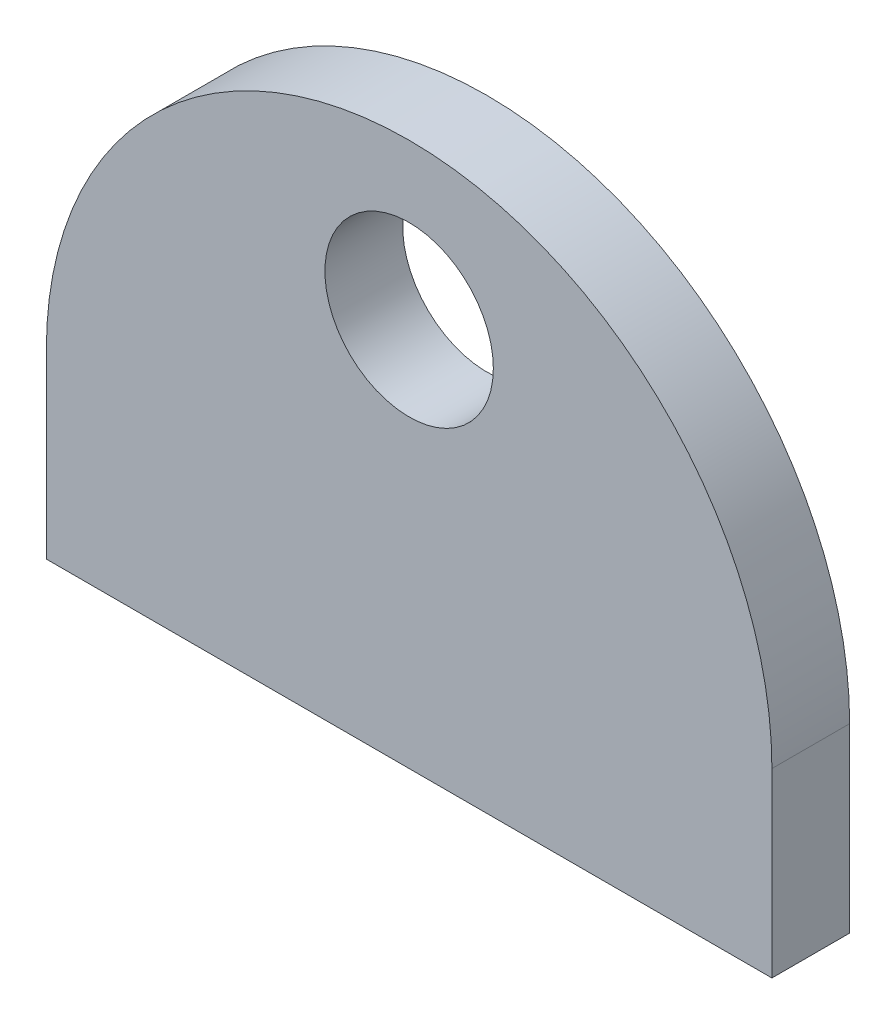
ISO-10303-21;
HEADER;
FILE_DESCRIPTION(('STEP AP214'),'2;1');
FILE_NAME('part.step','',(''),(''),'','','');
FILE_SCHEMA(('AUTOMOTIVE_DESIGN { 1 0 10303 214 1 1 1 1 }'));
ENDSEC;
DATA;
#1=APPLICATION_CONTEXT('core data for automotive mechanical design processes');
#2=APPLICATION_PROTOCOL_DEFINITION('international standard','automotive_design',2000,#1);
#3=PRODUCT_CONTEXT('',#1,'mechanical');
#4=PRODUCT('Part','Part','',(#3));
#5=PRODUCT_RELATED_PRODUCT_CATEGORY('part','',(#4));
#6=PRODUCT_DEFINITION_FORMATION('','',#4);
#7=PRODUCT_DEFINITION_CONTEXT('part definition',#1,'design');
#8=PRODUCT_DEFINITION('design','',#6,#7);
#9=PRODUCT_DEFINITION_SHAPE('','',#8);
#10=(LENGTH_UNIT() NAMED_UNIT(*) SI_UNIT(.MILLI.,.METRE.));
#11=(NAMED_UNIT(*) PLANE_ANGLE_UNIT() SI_UNIT($,.RADIAN.));
#12=(NAMED_UNIT(*) SI_UNIT($,.STERADIAN.) SOLID_ANGLE_UNIT());
#13=UNCERTAINTY_MEASURE_WITH_UNIT(LENGTH_MEASURE(1.E-05),#10,'distance_accuracy_value','');
#14=(GEOMETRIC_REPRESENTATION_CONTEXT(3) GLOBAL_UNCERTAINTY_ASSIGNED_CONTEXT((#13)) GLOBAL_UNIT_ASSIGNED_CONTEXT((#10,
#11,#12)) REPRESENTATION_CONTEXT('',''));
#15=CARTESIAN_POINT('',(0.,0.,0.));
#16=DIRECTION('',(0.,0.,1.));
#17=DIRECTION('',(1.,0.,0.));
#18=AXIS2_PLACEMENT_3D('',#15,#16,#17);
#19=CARTESIAN_POINT('',(0.,-8.,0.));
#20=DIRECTION('',(0.,0.,1.));
#21=DIRECTION('',(1.,0.,0.));
#22=AXIS2_PLACEMENT_3D('',#19,#20,#21);
#23=PLANE('',#22);
#24=DIRECTION('',(0.,1.,0.));
#25=VECTOR('',#24,1.);
#26=CARTESIAN_POINT('',(-14.,-15.,0.));
#27=LINE('',#26,#25);
#28=CARTESIAN_POINT('',(-14.,-15.,0.));
#29=VERTEX_POINT('',#28);
#30=CARTESIAN_POINT('',(-14.,-8.,0.));
#31=VERTEX_POINT('',#30);
#32=EDGE_CURVE('E73',#29,#31,#27,.T.);
#33=ORIENTED_EDGE('',*,*,#32,.T.);
#34=CARTESIAN_POINT('',(0.,-8.,0.));
#35=DIRECTION('',(0.,0.,1.));
#36=DIRECTION('',(1.,0.,0.));
#37=AXIS2_PLACEMENT_3D('',#34,#35,#36);
#38=CIRCLE('',#37,14.);
#39=CARTESIAN_POINT('',(14.,-8.,0.));
#40=VERTEX_POINT('',#39);
#41=EDGE_CURVE('E79',#40,#31,#38,.T.);
#42=ORIENTED_EDGE('',*,*,#41,.F.);
#43=DIRECTION('',(0.,-1.,0.));
#44=VECTOR('',#43,1.);
#45=CARTESIAN_POINT('',(14.,-8.,0.));
#46=LINE('',#45,#44);
#47=CARTESIAN_POINT('',(14.,-15.,0.));
#48=VERTEX_POINT('',#47);
#49=EDGE_CURVE('E84',#40,#48,#46,.T.);
#50=ORIENTED_EDGE('',*,*,#49,.T.);
#51=DIRECTION('',(1.,0.,0.));
#52=VECTOR('',#51,1.);
#53=CARTESIAN_POINT('',(-14.,-15.,0.));
#54=LINE('',#53,#52);
#55=EDGE_CURVE('E89',#29,#48,#54,.T.);
#56=ORIENTED_EDGE('',*,*,#55,.F.);
#57=EDGE_LOOP('',(#33,#42,#50,#56));
#58=FACE_BOUND('',#57,.T.);
#59=CARTESIAN_POINT('',(0.,0.,0.));
#60=DIRECTION('',(0.,0.,1.));
#61=DIRECTION('',(1.,0.,0.));
#62=AXIS2_PLACEMENT_3D('',#59,#60,#61);
#63=CIRCLE('',#62,3.25);
#64=CARTESIAN_POINT('',(3.25,0.,0.));
#65=VERTEX_POINT('',#64);
#66=EDGE_CURVE('E93',#65,#65,#63,.T.);
#67=ORIENTED_EDGE('',*,*,#66,.T.);
#68=EDGE_LOOP('',(#67));
#69=FACE_BOUND('',#68,.T.);
#70=ADVANCED_FACE('F30',(#58,#69),#23,.F.);
#71=CARTESIAN_POINT('',(0.,-8.,3.));
#72=DIRECTION('',(0.,0.,1.));
#73=DIRECTION('',(1.,0.,0.));
#74=AXIS2_PLACEMENT_3D('',#71,#72,#73);
#75=PLANE('',#74);
#76=DIRECTION('',(0.,1.,0.));
#77=VECTOR('',#76,1.);
#78=CARTESIAN_POINT('',(-14.,-15.,3.));
#79=LINE('',#78,#77);
#80=CARTESIAN_POINT('',(-14.,-15.,3.));
#81=VERTEX_POINT('',#80);
#82=CARTESIAN_POINT('',(-14.,-8.,3.));
#83=VERTEX_POINT('',#82);
#84=EDGE_CURVE('E74',#81,#83,#79,.T.);
#85=ORIENTED_EDGE('',*,*,#84,.F.);
#86=DIRECTION('',(1.,0.,0.));
#87=VECTOR('',#86,1.);
#88=CARTESIAN_POINT('',(-14.,-15.,3.));
#89=LINE('',#88,#87);
#90=CARTESIAN_POINT('',(14.,-15.,3.));
#91=VERTEX_POINT('',#90);
#92=EDGE_CURVE('E52',#81,#91,#89,.T.);
#93=ORIENTED_EDGE('',*,*,#92,.T.);
#94=DIRECTION('',(0.,-1.,0.));
#95=VECTOR('',#94,1.);
#96=CARTESIAN_POINT('',(14.,-8.,3.));
#97=LINE('',#96,#95);
#98=CARTESIAN_POINT('',(14.,-8.,3.));
#99=VERTEX_POINT('',#98);
#100=EDGE_CURVE('E102',#99,#91,#97,.T.);
#101=ORIENTED_EDGE('',*,*,#100,.F.);
#102=CARTESIAN_POINT('',(0.,-8.,3.));
#103=DIRECTION('',(0.,0.,1.));
#104=DIRECTION('',(1.,0.,0.));
#105=AXIS2_PLACEMENT_3D('',#102,#103,#104);
#106=CIRCLE('',#105,14.);
#107=EDGE_CURVE('E100',#99,#83,#106,.T.);
#108=ORIENTED_EDGE('',*,*,#107,.T.);
#109=EDGE_LOOP('',(#85,#93,#101,#108));
#110=FACE_BOUND('',#109,.T.);
#111=CARTESIAN_POINT('',(0.,0.,3.));
#112=DIRECTION('',(0.,0.,1.));
#113=DIRECTION('',(1.,0.,0.));
#114=AXIS2_PLACEMENT_3D('',#111,#112,#113);
#115=CIRCLE('',#114,3.25);
#116=CARTESIAN_POINT('',(3.25,0.,3.));
#117=VERTEX_POINT('',#116);
#118=EDGE_CURVE('E90',#117,#117,#115,.T.);
#119=ORIENTED_EDGE('',*,*,#118,.F.);
#120=EDGE_LOOP('',(#119));
#121=FACE_BOUND('',#120,.T.);
#122=ADVANCED_FACE('F110',(#110,#121),#75,.T.);
#123=CARTESIAN_POINT('',(-14.,-15.,3.));
#124=DIRECTION('',(-1.,0.,0.));
#125=DIRECTION('',(0.,0.,1.));
#126=AXIS2_PLACEMENT_3D('',#123,#124,#125);
#127=PLANE('',#126);
#128=ORIENTED_EDGE('',*,*,#32,.F.);
#129=DIRECTION('',(0.,0.,-1.));
#130=VECTOR('',#129,1.);
#131=CARTESIAN_POINT('',(-14.,-15.,3.));
#132=LINE('',#131,#130);
#133=EDGE_CURVE('E11',#81,#29,#132,.T.);
#134=ORIENTED_EDGE('',*,*,#133,.F.);
#135=ORIENTED_EDGE('',*,*,#84,.T.);
#136=DIRECTION('',(0.,0.,-1.));
#137=VECTOR('',#136,1.);
#138=CARTESIAN_POINT('',(-14.,-8.,3.));
#139=LINE('',#138,#137);
#140=EDGE_CURVE('E34',#83,#31,#139,.T.);
#141=ORIENTED_EDGE('',*,*,#140,.T.);
#142=EDGE_LOOP('',(#128,#134,#135,#141));
#143=FACE_BOUND('',#142,.T.);
#144=ADVANCED_FACE('F32',(#143),#127,.T.);
#145=CARTESIAN_POINT('',(-14.,-15.,3.));
#146=DIRECTION('',(0.,1.,0.));
#147=DIRECTION('',(-1.,0.,0.));
#148=AXIS2_PLACEMENT_3D('',#145,#146,#147);
#149=PLANE('',#148);
#150=ORIENTED_EDGE('',*,*,#55,.T.);
#151=DIRECTION('',(0.,0.,-1.));
#152=VECTOR('',#151,1.);
#153=CARTESIAN_POINT('',(14.,-15.,3.));
#154=LINE('',#153,#152);
#155=EDGE_CURVE('E39',#91,#48,#154,.T.);
#156=ORIENTED_EDGE('',*,*,#155,.F.);
#157=ORIENTED_EDGE('',*,*,#92,.F.);
#158=ORIENTED_EDGE('',*,*,#133,.T.);
#159=EDGE_LOOP('',(#150,#156,#157,#158));
#160=FACE_BOUND('',#159,.T.);
#161=ADVANCED_FACE('F109',(#160),#149,.F.);
#162=CARTESIAN_POINT('',(14.,-8.,3.));
#163=DIRECTION('',(1.,0.,0.));
#164=DIRECTION('',(0.,1.,0.));
#165=AXIS2_PLACEMENT_3D('',#162,#163,#164);
#166=PLANE('',#165);
#167=ORIENTED_EDGE('',*,*,#49,.F.);
#168=DIRECTION('',(0.,0.,-1.));
#169=VECTOR('',#168,1.);
#170=CARTESIAN_POINT('',(14.,-8.,3.));
#171=LINE('',#170,#169);
#172=EDGE_CURVE('E77',#99,#40,#171,.T.);
#173=ORIENTED_EDGE('',*,*,#172,.F.);
#174=ORIENTED_EDGE('',*,*,#100,.T.);
#175=ORIENTED_EDGE('',*,*,#155,.T.);
#176=EDGE_LOOP('',(#167,#173,#174,#175));
#177=FACE_BOUND('',#176,.T.);
#178=ADVANCED_FACE('F107',(#177),#166,.T.);
#179=CARTESIAN_POINT('',(0.,-8.,3.));
#180=DIRECTION('',(0.,0.,-1.));
#181=DIRECTION('',(-1.,0.,0.));
#182=AXIS2_PLACEMENT_3D('',#179,#180,#181);
#183=CYLINDRICAL_SURFACE('',#182,14.);
#184=ORIENTED_EDGE('',*,*,#41,.T.);
#185=ORIENTED_EDGE('',*,*,#140,.F.);
#186=ORIENTED_EDGE('',*,*,#107,.F.);
#187=ORIENTED_EDGE('',*,*,#172,.T.);
#188=EDGE_LOOP('',(#184,#185,#186,#187));
#189=FACE_BOUND('',#188,.T.);
#190=ADVANCED_FACE('F80',(#189),#183,.T.);
#191=CARTESIAN_POINT('',(0.,0.,3.));
#192=DIRECTION('',(0.,0.,-1.));
#193=DIRECTION('',(-1.,0.,0.));
#194=AXIS2_PLACEMENT_3D('',#191,#192,#193);
#195=CYLINDRICAL_SURFACE('',#194,3.25);
#196=ORIENTED_EDGE('',*,*,#118,.T.);
#197=EDGE_LOOP('',(#196));
#198=FACE_BOUND('',#197,.T.);
#199=ORIENTED_EDGE('',*,*,#66,.F.);
#200=EDGE_LOOP('',(#199));
#201=FACE_BOUND('',#200,.T.);
#202=ADVANCED_FACE('F116',(#198,#201),#195,.F.);
#203=CLOSED_SHELL('',(#70,#122,#144,#161,#178,#190,#202));
#204=MANIFOLD_SOLID_BREP('B2',#203);
#205=ADVANCED_BREP_SHAPE_REPRESENTATION('',(#18,#204),#14);
#206=SHAPE_DEFINITION_REPRESENTATION(#9,#205);
ENDSEC;
END-ISO-10303-21;
